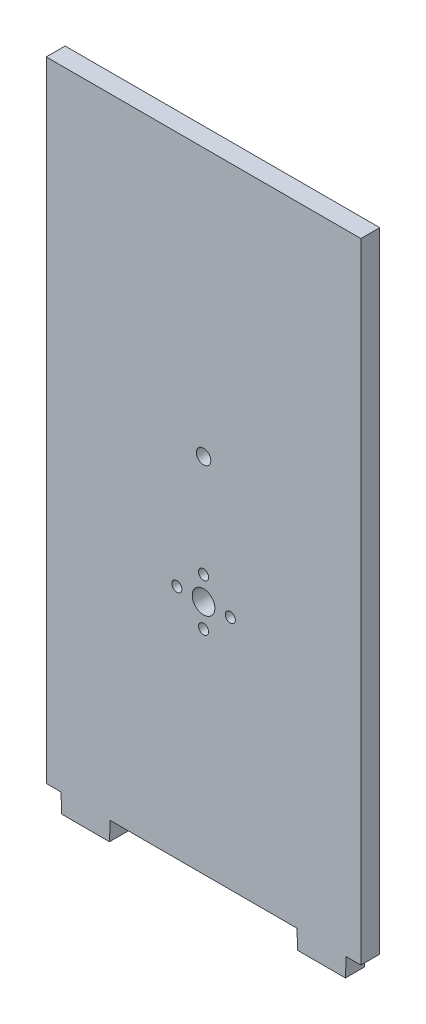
ISO-10303-21;
HEADER;
FILE_DESCRIPTION(('STEP AP214'),'2;1');
FILE_NAME('part.step','',(''),(''),'','','');
FILE_SCHEMA(('AUTOMOTIVE_DESIGN { 1 0 10303 214 1 1 1 1 }'));
ENDSEC;
DATA;
#1=APPLICATION_CONTEXT('core data for automotive mechanical design processes');
#2=APPLICATION_PROTOCOL_DEFINITION('international standard','automotive_design',2000,#1);
#3=PRODUCT_CONTEXT('',#1,'mechanical');
#4=PRODUCT('Part','Part','',(#3));
#5=PRODUCT_RELATED_PRODUCT_CATEGORY('part','',(#4));
#6=PRODUCT_DEFINITION_FORMATION('','',#4);
#7=PRODUCT_DEFINITION_CONTEXT('part definition',#1,'design');
#8=PRODUCT_DEFINITION('design','',#6,#7);
#9=PRODUCT_DEFINITION_SHAPE('','',#8);
#10=(LENGTH_UNIT() NAMED_UNIT(*) SI_UNIT(.MILLI.,.METRE.));
#11=(NAMED_UNIT(*) PLANE_ANGLE_UNIT() SI_UNIT($,.RADIAN.));
#12=(NAMED_UNIT(*) SI_UNIT($,.STERADIAN.) SOLID_ANGLE_UNIT());
#13=UNCERTAINTY_MEASURE_WITH_UNIT(LENGTH_MEASURE(1.E-05),#10,'distance_accuracy_value','');
#14=(GEOMETRIC_REPRESENTATION_CONTEXT(3) GLOBAL_UNCERTAINTY_ASSIGNED_CONTEXT((#13)) GLOBAL_UNIT_ASSIGNED_CONTEXT((#10,
#11,#12)) REPRESENTATION_CONTEXT('',''));
#15=CARTESIAN_POINT('',(0.,0.,0.));
#16=DIRECTION('',(0.,0.,1.));
#17=DIRECTION('',(1.,0.,0.));
#18=AXIS2_PLACEMENT_3D('',#15,#16,#17);
#19=CARTESIAN_POINT('',(-50.,-100.,6.));
#20=DIRECTION('',(0.,1.,0.));
#21=DIRECTION('',(0.,0.,1.));
#22=AXIS2_PLACEMENT_3D('',#19,#20,#21);
#23=PLANE('',#22);
#24=DIRECTION('',(1.,0.,0.));
#25=VECTOR('',#24,1.);
#26=CARTESIAN_POINT('',(-50.,-100.,6.));
#27=LINE('',#26,#25);
#28=CARTESIAN_POINT('',(45.3095246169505,-100.,6.));
#29=VERTEX_POINT('',#28);
#30=CARTESIAN_POINT('',(50.,-100.,6.));
#31=VERTEX_POINT('',#30);
#32=EDGE_CURVE('E55',#29,#31,#27,.T.);
#33=ORIENTED_EDGE('',*,*,#32,.F.);
#34=DIRECTION('',(0.,0.,1.));
#35=VECTOR('',#34,1.);
#36=CARTESIAN_POINT('',(45.3095246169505,-100.,-16.7318468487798));
#37=LINE('',#36,#35);
#38=CARTESIAN_POINT('',(45.3095246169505,-100.,0.));
#39=VERTEX_POINT('',#38);
#40=EDGE_CURVE('E144',#39,#29,#37,.T.);
#41=ORIENTED_EDGE('',*,*,#40,.F.);
#42=DIRECTION('',(1.,0.,0.));
#43=VECTOR('',#42,1.);
#44=CARTESIAN_POINT('',(-50.,-100.,0.));
#45=LINE('',#44,#43);
#46=CARTESIAN_POINT('',(50.,-100.,0.));
#47=VERTEX_POINT('',#46);
#48=EDGE_CURVE('E130',#39,#47,#45,.T.);
#49=ORIENTED_EDGE('',*,*,#48,.T.);
#50=DIRECTION('',(0.,0.,-1.));
#51=VECTOR('',#50,1.);
#52=CARTESIAN_POINT('',(50.,-100.,6.));
#53=LINE('',#52,#51);
#54=EDGE_CURVE('E48',#31,#47,#53,.T.);
#55=ORIENTED_EDGE('',*,*,#54,.F.);
#56=EDGE_LOOP('',(#33,#41,#49,#55));
#57=FACE_BOUND('',#56,.T.);
#58=ADVANCED_FACE('F39',(#57),#23,.F.);
#59=CARTESIAN_POINT('',(-29.6904753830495,-100.,0.));
#60=VERTEX_POINT('',#59);
#61=CARTESIAN_POINT('',(29.6904753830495,-100.,0.));
#62=VERTEX_POINT('',#61);
#63=EDGE_CURVE('E140',#60,#62,#45,.T.);
#64=ORIENTED_EDGE('',*,*,#63,.T.);
#65=DIRECTION('',(0.,0.,1.));
#66=VECTOR('',#65,1.);
#67=CARTESIAN_POINT('',(29.6904753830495,-100.,-16.7318468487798));
#68=LINE('',#67,#66);
#69=CARTESIAN_POINT('',(29.6904753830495,-100.,6.));
#70=VERTEX_POINT('',#69);
#71=EDGE_CURVE('E63',#62,#70,#68,.T.);
#72=ORIENTED_EDGE('',*,*,#71,.T.);
#73=CARTESIAN_POINT('',(-29.6904753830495,-100.,6.));
#74=VERTEX_POINT('',#73);
#75=EDGE_CURVE('E224',#74,#70,#27,.T.);
#76=ORIENTED_EDGE('',*,*,#75,.F.);
#77=DIRECTION('',(0.,0.,1.));
#78=VECTOR('',#77,1.);
#79=CARTESIAN_POINT('',(-29.6904753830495,-100.,-16.7318468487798));
#80=LINE('',#79,#78);
#81=EDGE_CURVE('E193',#60,#74,#80,.T.);
#82=ORIENTED_EDGE('',*,*,#81,.F.);
#83=EDGE_LOOP('',(#64,#72,#76,#82));
#84=FACE_BOUND('',#83,.T.);
#85=ADVANCED_FACE('F340',(#84),#23,.F.);
#86=CARTESIAN_POINT('',(-50.,-100.,6.));
#87=DIRECTION('',(1.,0.,0.));
#88=DIRECTION('',(0.,0.,-1.));
#89=AXIS2_PLACEMENT_3D('',#86,#87,#88);
#90=PLANE('',#89);
#91=DIRECTION('',(0.,-1.,0.));
#92=VECTOR('',#91,1.);
#93=CARTESIAN_POINT('',(-50.,-100.,0.));
#94=LINE('',#93,#92);
#95=CARTESIAN_POINT('',(-50.,100.,0.));
#96=VERTEX_POINT('',#95);
#97=CARTESIAN_POINT('',(-50.,-100.,0.));
#98=VERTEX_POINT('',#97);
#99=EDGE_CURVE('E141',#96,#98,#94,.T.);
#100=ORIENTED_EDGE('',*,*,#99,.T.);
#101=DIRECTION('',(0.,0.,-1.));
#102=VECTOR('',#101,1.);
#103=CARTESIAN_POINT('',(-50.,-100.,6.));
#104=LINE('',#103,#102);
#105=CARTESIAN_POINT('',(-50.,-100.,6.));
#106=VERTEX_POINT('',#105);
#107=EDGE_CURVE('E11',#106,#98,#104,.T.);
#108=ORIENTED_EDGE('',*,*,#107,.F.);
#109=DIRECTION('',(0.,-1.,0.));
#110=VECTOR('',#109,1.);
#111=CARTESIAN_POINT('',(-50.,-100.,6.));
#112=LINE('',#111,#110);
#113=CARTESIAN_POINT('',(-50.,100.,6.));
#114=VERTEX_POINT('',#113);
#115=EDGE_CURVE('E214',#114,#106,#112,.T.);
#116=ORIENTED_EDGE('',*,*,#115,.F.);
#117=DIRECTION('',(0.,0.,-1.));
#118=VECTOR('',#117,1.);
#119=CARTESIAN_POINT('',(-50.,100.,6.));
#120=LINE('',#119,#118);
#121=EDGE_CURVE('E230',#114,#96,#120,.T.);
#122=ORIENTED_EDGE('',*,*,#121,.T.);
#123=EDGE_LOOP('',(#100,#108,#116,#122));
#124=FACE_BOUND('',#123,.T.);
#125=ADVANCED_FACE('F41',(#124),#90,.F.);
#126=CARTESIAN_POINT('',(-45.3095246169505,-100.,0.));
#127=VERTEX_POINT('',#126);
#128=EDGE_CURVE('E143',#98,#127,#45,.T.);
#129=ORIENTED_EDGE('',*,*,#128,.T.);
#130=DIRECTION('',(0.,0.,1.));
#131=VECTOR('',#130,1.);
#132=CARTESIAN_POINT('',(-45.3095246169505,-100.,-16.7318468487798));
#133=LINE('',#132,#131);
#134=CARTESIAN_POINT('',(-45.3095246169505,-100.,6.));
#135=VERTEX_POINT('',#134);
#136=EDGE_CURVE('E204',#127,#135,#133,.T.);
#137=ORIENTED_EDGE('',*,*,#136,.T.);
#138=EDGE_CURVE('E219',#106,#135,#27,.T.);
#139=ORIENTED_EDGE('',*,*,#138,.F.);
#140=ORIENTED_EDGE('',*,*,#107,.T.);
#141=EDGE_LOOP('',(#129,#137,#139,#140));
#142=FACE_BOUND('',#141,.T.);
#143=ADVANCED_FACE('F341',(#142),#23,.F.);
#144=CARTESIAN_POINT('',(50.,-100.,6.));
#145=DIRECTION('',(-1.,0.,0.));
#146=DIRECTION('',(0.,0.,1.));
#147=AXIS2_PLACEMENT_3D('',#144,#145,#146);
#148=PLANE('',#147);
#149=DIRECTION('',(0.,1.,0.));
#150=VECTOR('',#149,1.);
#151=CARTESIAN_POINT('',(50.,-100.,0.));
#152=LINE('',#151,#150);
#153=CARTESIAN_POINT('',(50.,100.,0.));
#154=VERTEX_POINT('',#153);
#155=EDGE_CURVE('E137',#47,#154,#152,.T.);
#156=ORIENTED_EDGE('',*,*,#155,.T.);
#157=DIRECTION('',(0.,0.,-1.));
#158=VECTOR('',#157,1.);
#159=CARTESIAN_POINT('',(50.,100.,6.));
#160=LINE('',#159,#158);
#161=CARTESIAN_POINT('',(50.,100.,6.));
#162=VERTEX_POINT('',#161);
#163=EDGE_CURVE('E243',#162,#154,#160,.T.);
#164=ORIENTED_EDGE('',*,*,#163,.F.);
#165=DIRECTION('',(0.,1.,0.));
#166=VECTOR('',#165,1.);
#167=CARTESIAN_POINT('',(50.,-100.,6.));
#168=LINE('',#167,#166);
#169=EDGE_CURVE('E223',#31,#162,#168,.T.);
#170=ORIENTED_EDGE('',*,*,#169,.F.);
#171=ORIENTED_EDGE('',*,*,#54,.T.);
#172=EDGE_LOOP('',(#156,#164,#170,#171));
#173=FACE_BOUND('',#172,.T.);
#174=ADVANCED_FACE('F249',(#173),#148,.F.);
#175=CARTESIAN_POINT('',(-50.,100.,6.));
#176=DIRECTION('',(0.,-1.,0.));
#177=DIRECTION('',(0.,0.,-1.));
#178=AXIS2_PLACEMENT_3D('',#175,#176,#177);
#179=PLANE('',#178);
#180=DIRECTION('',(-1.,0.,0.));
#181=VECTOR('',#180,1.);
#182=CARTESIAN_POINT('',(-50.,100.,0.));
#183=LINE('',#182,#181);
#184=EDGE_CURVE('E218',#154,#96,#183,.T.);
#185=ORIENTED_EDGE('',*,*,#184,.T.);
#186=ORIENTED_EDGE('',*,*,#121,.F.);
#187=DIRECTION('',(-1.,0.,0.));
#188=VECTOR('',#187,1.);
#189=CARTESIAN_POINT('',(-50.,100.,6.));
#190=LINE('',#189,#188);
#191=EDGE_CURVE('E227',#162,#114,#190,.T.);
#192=ORIENTED_EDGE('',*,*,#191,.F.);
#193=ORIENTED_EDGE('',*,*,#163,.T.);
#194=EDGE_LOOP('',(#185,#186,#192,#193));
#195=FACE_BOUND('',#194,.T.);
#196=ADVANCED_FACE('F325',(#195),#179,.F.);
#197=CARTESIAN_POINT('',(0.,0.,6.));
#198=DIRECTION('',(0.,0.,-1.));
#199=DIRECTION('',(-1.,0.,0.));
#200=AXIS2_PLACEMENT_3D('',#197,#198,#199);
#201=PLANE('',#200);
#202=CARTESIAN_POINT('',(0.,15.,6.));
#203=DIRECTION('',(0.,0.,1.));
#204=DIRECTION('',(1.,0.,0.));
#205=AXIS2_PLACEMENT_3D('',#202,#203,#204);
#206=CIRCLE('',#205,2.3);
#207=CARTESIAN_POINT('',(2.30000000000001,15.,6.));
#208=VERTEX_POINT('',#207);
#209=EDGE_CURVE('E273',#208,#208,#206,.T.);
#210=ORIENTED_EDGE('',*,*,#209,.F.);
#211=EDGE_LOOP('',(#210));
#212=FACE_BOUND('',#211,.T.);
#213=CARTESIAN_POINT('',(8.50000000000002,-25.,6.));
#214=DIRECTION('',(0.,0.,1.));
#215=DIRECTION('',(1.,0.,0.));
#216=AXIS2_PLACEMENT_3D('',#213,#214,#215);
#217=CIRCLE('',#216,1.6);
#218=CARTESIAN_POINT('',(10.1,-25.,6.));
#219=VERTEX_POINT('',#218);
#220=EDGE_CURVE('E295',#219,#219,#217,.T.);
#221=ORIENTED_EDGE('',*,*,#220,.F.);
#222=EDGE_LOOP('',(#221));
#223=FACE_BOUND('',#222,.T.);
#224=CARTESIAN_POINT('',(0.,-32.5,6.));
#225=DIRECTION('',(0.,0.,1.));
#226=DIRECTION('',(1.,0.,0.));
#227=AXIS2_PLACEMENT_3D('',#224,#225,#226);
#228=CIRCLE('',#227,1.6);
#229=CARTESIAN_POINT('',(1.60000000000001,-32.5,6.));
#230=VERTEX_POINT('',#229);
#231=EDGE_CURVE('E287',#230,#230,#228,.T.);
#232=ORIENTED_EDGE('',*,*,#231,.F.);
#233=EDGE_LOOP('',(#232));
#234=FACE_BOUND('',#233,.T.);
#235=CARTESIAN_POINT('',(0.,-17.5,6.));
#236=DIRECTION('',(0.,0.,1.));
#237=DIRECTION('',(1.,0.,0.));
#238=AXIS2_PLACEMENT_3D('',#235,#236,#237);
#239=CIRCLE('',#238,1.6);
#240=CARTESIAN_POINT('',(1.60000000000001,-17.5,6.));
#241=VERTEX_POINT('',#240);
#242=EDGE_CURVE('E286',#241,#241,#239,.T.);
#243=ORIENTED_EDGE('',*,*,#242,.F.);
#244=EDGE_LOOP('',(#243));
#245=FACE_BOUND('',#244,.T.);
#246=CARTESIAN_POINT('',(0.,-25.,6.));
#247=DIRECTION('',(0.,0.,1.));
#248=DIRECTION('',(1.,0.,0.));
#249=AXIS2_PLACEMENT_3D('',#246,#247,#248);
#250=CIRCLE('',#249,3.6);
#251=CARTESIAN_POINT('',(3.60000000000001,-25.,6.));
#252=VERTEX_POINT('',#251);
#253=EDGE_CURVE('E303',#252,#252,#250,.T.);
#254=ORIENTED_EDGE('',*,*,#253,.F.);
#255=EDGE_LOOP('',(#254));
#256=FACE_BOUND('',#255,.T.);
#257=CARTESIAN_POINT('',(-8.49999999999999,-25.,6.));
#258=DIRECTION('',(0.,0.,1.));
#259=DIRECTION('',(1.,0.,0.));
#260=AXIS2_PLACEMENT_3D('',#257,#258,#259);
#261=CIRCLE('',#260,1.6);
#262=CARTESIAN_POINT('',(-6.89999999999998,-25.,6.));
#263=VERTEX_POINT('',#262);
#264=EDGE_CURVE('E317',#263,#263,#261,.T.);
#265=ORIENTED_EDGE('',*,*,#264,.F.);
#266=EDGE_LOOP('',(#265));
#267=FACE_BOUND('',#266,.T.);
#268=ORIENTED_EDGE('',*,*,#115,.T.);
#269=ORIENTED_EDGE('',*,*,#138,.T.);
#270=DIRECTION('',(0.0348994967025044,-0.999390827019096,0.));
#271=VECTOR('',#270,1.);
#272=CARTESIAN_POINT('',(-45.3095246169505,-100.,6.));
#273=LINE('',#272,#271);
#274=CARTESIAN_POINT('',(-45.1,-106.,6.));
#275=VERTEX_POINT('',#274);
#276=EDGE_CURVE('E179',#135,#275,#273,.T.);
#277=ORIENTED_EDGE('',*,*,#276,.T.);
#278=DIRECTION('',(1.,0.,0.));
#279=VECTOR('',#278,1.);
#280=CARTESIAN_POINT('',(-45.1,-106.,6.));
#281=LINE('',#280,#279);
#282=CARTESIAN_POINT('',(-29.9,-106.,6.));
#283=VERTEX_POINT('',#282);
#284=EDGE_CURVE('E178',#275,#283,#281,.T.);
#285=ORIENTED_EDGE('',*,*,#284,.T.);
#286=DIRECTION('',(0.0348994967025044,0.999390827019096,0.));
#287=VECTOR('',#286,1.);
#288=CARTESIAN_POINT('',(-29.6904753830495,-100.,6.));
#289=LINE('',#288,#287);
#290=EDGE_CURVE('E184',#283,#74,#289,.T.);
#291=ORIENTED_EDGE('',*,*,#290,.T.);
#292=ORIENTED_EDGE('',*,*,#75,.T.);
#293=DIRECTION('',(0.0348994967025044,-0.999390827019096,0.));
#294=VECTOR('',#293,1.);
#295=CARTESIAN_POINT('',(29.6904753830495,-100.,6.));
#296=LINE('',#295,#294);
#297=CARTESIAN_POINT('',(29.9,-106.,6.));
#298=VERTEX_POINT('',#297);
#299=EDGE_CURVE('E154',#70,#298,#296,.T.);
#300=ORIENTED_EDGE('',*,*,#299,.T.);
#301=DIRECTION('',(1.,0.,0.));
#302=VECTOR('',#301,1.);
#303=CARTESIAN_POINT('',(29.9,-106.,6.));
#304=LINE('',#303,#302);
#305=CARTESIAN_POINT('',(45.1,-106.,6.));
#306=VERTEX_POINT('',#305);
#307=EDGE_CURVE('E162',#298,#306,#304,.T.);
#308=ORIENTED_EDGE('',*,*,#307,.T.);
#309=DIRECTION('',(0.0348994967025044,0.999390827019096,0.));
#310=VECTOR('',#309,1.);
#311=CARTESIAN_POINT('',(45.3095246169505,-100.,6.));
#312=LINE('',#311,#310);
#313=EDGE_CURVE('E158',#306,#29,#312,.T.);
#314=ORIENTED_EDGE('',*,*,#313,.T.);
#315=ORIENTED_EDGE('',*,*,#32,.T.);
#316=ORIENTED_EDGE('',*,*,#169,.T.);
#317=ORIENTED_EDGE('',*,*,#191,.T.);
#318=EDGE_LOOP('',(#268,#269,#277,#285,#291,#292,#300,#308,#314,#315,#316,#317));
#319=FACE_BOUND('',#318,.T.);
#320=ADVANCED_FACE('F253',(#212,#223,#234,#245,#256,#267,#319),#201,.F.);
#321=CARTESIAN_POINT('',(0.,0.,0.));
#322=DIRECTION('',(0.,0.,-1.));
#323=DIRECTION('',(-1.,0.,0.));
#324=AXIS2_PLACEMENT_3D('',#321,#322,#323);
#325=PLANE('',#324);
#326=CARTESIAN_POINT('',(0.,15.,0.));
#327=DIRECTION('',(0.,0.,1.));
#328=DIRECTION('',(1.,0.,0.));
#329=AXIS2_PLACEMENT_3D('',#326,#327,#328);
#330=CIRCLE('',#329,2.3);
#331=CARTESIAN_POINT('',(2.30000000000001,15.,0.));
#332=VERTEX_POINT('',#331);
#333=EDGE_CURVE('E269',#332,#332,#330,.T.);
#334=ORIENTED_EDGE('',*,*,#333,.T.);
#335=EDGE_LOOP('',(#334));
#336=FACE_BOUND('',#335,.T.);
#337=CARTESIAN_POINT('',(8.50000000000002,-25.,0.));
#338=DIRECTION('',(0.,0.,1.));
#339=DIRECTION('',(1.,0.,0.));
#340=AXIS2_PLACEMENT_3D('',#337,#338,#339);
#341=CIRCLE('',#340,1.6);
#342=CARTESIAN_POINT('',(10.1,-25.,0.));
#343=VERTEX_POINT('',#342);
#344=EDGE_CURVE('E291',#343,#343,#341,.T.);
#345=ORIENTED_EDGE('',*,*,#344,.T.);
#346=EDGE_LOOP('',(#345));
#347=FACE_BOUND('',#346,.T.);
#348=CARTESIAN_POINT('',(0.,-32.5,0.));
#349=DIRECTION('',(0.,0.,1.));
#350=DIRECTION('',(1.,0.,0.));
#351=AXIS2_PLACEMENT_3D('',#348,#349,#350);
#352=CIRCLE('',#351,1.6);
#353=CARTESIAN_POINT('',(1.60000000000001,-32.5,0.));
#354=VERTEX_POINT('',#353);
#355=EDGE_CURVE('E282',#354,#354,#352,.T.);
#356=ORIENTED_EDGE('',*,*,#355,.T.);
#357=EDGE_LOOP('',(#356));
#358=FACE_BOUND('',#357,.T.);
#359=CARTESIAN_POINT('',(0.,-17.5,0.));
#360=DIRECTION('',(0.,0.,1.));
#361=DIRECTION('',(1.,0.,0.));
#362=AXIS2_PLACEMENT_3D('',#359,#360,#361);
#363=CIRCLE('',#362,1.6);
#364=CARTESIAN_POINT('',(1.60000000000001,-17.5,0.));
#365=VERTEX_POINT('',#364);
#366=EDGE_CURVE('E307',#365,#365,#363,.T.);
#367=ORIENTED_EDGE('',*,*,#366,.T.);
#368=EDGE_LOOP('',(#367));
#369=FACE_BOUND('',#368,.T.);
#370=CARTESIAN_POINT('',(0.,-25.,0.));
#371=DIRECTION('',(0.,0.,1.));
#372=DIRECTION('',(1.,0.,0.));
#373=AXIS2_PLACEMENT_3D('',#370,#371,#372);
#374=CIRCLE('',#373,3.6);
#375=CARTESIAN_POINT('',(3.60000000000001,-25.,0.));
#376=VERTEX_POINT('',#375);
#377=EDGE_CURVE('E279',#376,#376,#374,.T.);
#378=ORIENTED_EDGE('',*,*,#377,.T.);
#379=EDGE_LOOP('',(#378));
#380=FACE_BOUND('',#379,.T.);
#381=CARTESIAN_POINT('',(-8.49999999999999,-25.,0.));
#382=DIRECTION('',(0.,0.,1.));
#383=DIRECTION('',(1.,0.,0.));
#384=AXIS2_PLACEMENT_3D('',#381,#382,#383);
#385=CIRCLE('',#384,1.6);
#386=CARTESIAN_POINT('',(-6.89999999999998,-25.,0.));
#387=VERTEX_POINT('',#386);
#388=EDGE_CURVE('E299',#387,#387,#385,.T.);
#389=ORIENTED_EDGE('',*,*,#388,.T.);
#390=EDGE_LOOP('',(#389));
#391=FACE_BOUND('',#390,.T.);
#392=ORIENTED_EDGE('',*,*,#99,.F.);
#393=ORIENTED_EDGE('',*,*,#184,.F.);
#394=ORIENTED_EDGE('',*,*,#155,.F.);
#395=ORIENTED_EDGE('',*,*,#48,.F.);
#396=DIRECTION('',(0.0348994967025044,0.999390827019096,0.));
#397=VECTOR('',#396,1.);
#398=CARTESIAN_POINT('',(45.3095246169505,-100.,0.));
#399=LINE('',#398,#397);
#400=CARTESIAN_POINT('',(45.1,-106.,0.));
#401=VERTEX_POINT('',#400);
#402=EDGE_CURVE('E134',#401,#39,#399,.T.);
#403=ORIENTED_EDGE('',*,*,#402,.F.);
#404=DIRECTION('',(1.,0.,0.));
#405=VECTOR('',#404,1.);
#406=CARTESIAN_POINT('',(29.9,-106.,0.));
#407=LINE('',#406,#405);
#408=CARTESIAN_POINT('',(29.9,-106.,0.));
#409=VERTEX_POINT('',#408);
#410=EDGE_CURVE('E164',#409,#401,#407,.T.);
#411=ORIENTED_EDGE('',*,*,#410,.F.);
#412=DIRECTION('',(0.0348994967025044,-0.999390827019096,0.));
#413=VECTOR('',#412,1.);
#414=CARTESIAN_POINT('',(29.6904753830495,-100.,0.));
#415=LINE('',#414,#413);
#416=EDGE_CURVE('E168',#62,#409,#415,.T.);
#417=ORIENTED_EDGE('',*,*,#416,.F.);
#418=ORIENTED_EDGE('',*,*,#63,.F.);
#419=DIRECTION('',(0.0348994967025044,0.999390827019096,0.));
#420=VECTOR('',#419,1.);
#421=CARTESIAN_POINT('',(-29.6904753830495,-100.,0.));
#422=LINE('',#421,#420);
#423=CARTESIAN_POINT('',(-29.9,-106.,0.));
#424=VERTEX_POINT('',#423);
#425=EDGE_CURVE('E183',#424,#60,#422,.T.);
#426=ORIENTED_EDGE('',*,*,#425,.F.);
#427=DIRECTION('',(1.,0.,0.));
#428=VECTOR('',#427,1.);
#429=CARTESIAN_POINT('',(-45.1,-106.,0.));
#430=LINE('',#429,#428);
#431=CARTESIAN_POINT('',(-45.1,-106.,0.));
#432=VERTEX_POINT('',#431);
#433=EDGE_CURVE('E194',#432,#424,#430,.T.);
#434=ORIENTED_EDGE('',*,*,#433,.F.);
#435=DIRECTION('',(0.0348994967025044,-0.999390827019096,0.));
#436=VECTOR('',#435,1.);
#437=CARTESIAN_POINT('',(-45.3095246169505,-100.,0.));
#438=LINE('',#437,#436);
#439=EDGE_CURVE('E200',#127,#432,#438,.T.);
#440=ORIENTED_EDGE('',*,*,#439,.F.);
#441=ORIENTED_EDGE('',*,*,#128,.F.);
#442=EDGE_LOOP('',(#392,#393,#394,#395,#403,#411,#417,#418,#426,#434,#440,#441));
#443=FACE_BOUND('',#442,.T.);
#444=ADVANCED_FACE('F132',(#336,#347,#358,#369,#380,#391,#443),#325,.T.);
#445=CARTESIAN_POINT('',(-29.6904753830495,-100.,-16.7318468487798));
#446=DIRECTION('',(0.999390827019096,-0.0348994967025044,0.));
#447=DIRECTION('',(0.0348994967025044,0.999390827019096,0.));
#448=AXIS2_PLACEMENT_3D('',#445,#446,#447);
#449=PLANE('',#448);
#450=DIRECTION('',(0.,0.,1.));
#451=VECTOR('',#450,1.);
#452=CARTESIAN_POINT('',(-29.9,-106.,-16.7318468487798));
#453=LINE('',#452,#451);
#454=EDGE_CURVE('E198',#424,#283,#453,.T.);
#455=ORIENTED_EDGE('',*,*,#454,.F.);
#456=ORIENTED_EDGE('',*,*,#425,.T.);
#457=ORIENTED_EDGE('',*,*,#81,.T.);
#458=ORIENTED_EDGE('',*,*,#290,.F.);
#459=EDGE_LOOP('',(#455,#456,#457,#458));
#460=FACE_BOUND('',#459,.T.);
#461=ADVANCED_FACE('F332',(#460),#449,.T.);
#462=CARTESIAN_POINT('',(-45.3095246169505,-100.,-16.7318468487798));
#463=DIRECTION('',(-0.999390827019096,-0.0348994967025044,0.));
#464=DIRECTION('',(0.0348994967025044,-0.999390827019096,0.));
#465=AXIS2_PLACEMENT_3D('',#462,#463,#464);
#466=PLANE('',#465);
#467=ORIENTED_EDGE('',*,*,#136,.F.);
#468=ORIENTED_EDGE('',*,*,#439,.T.);
#469=DIRECTION('',(0.,0.,1.));
#470=VECTOR('',#469,1.);
#471=CARTESIAN_POINT('',(-45.1,-106.,-16.7318468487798));
#472=LINE('',#471,#470);
#473=EDGE_CURVE('E199',#432,#275,#472,.T.);
#474=ORIENTED_EDGE('',*,*,#473,.T.);
#475=ORIENTED_EDGE('',*,*,#276,.F.);
#476=EDGE_LOOP('',(#467,#468,#474,#475));
#477=FACE_BOUND('',#476,.T.);
#478=ADVANCED_FACE('F357',(#477),#466,.T.);
#479=CARTESIAN_POINT('',(-45.1,-106.,-16.7318468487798));
#480=DIRECTION('',(0.,-1.,0.));
#481=DIRECTION('',(0.,0.,-1.));
#482=AXIS2_PLACEMENT_3D('',#479,#480,#481);
#483=PLANE('',#482);
#484=ORIENTED_EDGE('',*,*,#473,.F.);
#485=ORIENTED_EDGE('',*,*,#433,.T.);
#486=ORIENTED_EDGE('',*,*,#454,.T.);
#487=ORIENTED_EDGE('',*,*,#284,.F.);
#488=EDGE_LOOP('',(#484,#485,#486,#487));
#489=FACE_BOUND('',#488,.T.);
#490=ADVANCED_FACE('F361',(#489),#483,.T.);
#491=CARTESIAN_POINT('',(45.3095246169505,-100.,-16.7318468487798));
#492=DIRECTION('',(0.999390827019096,-0.0348994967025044,0.));
#493=DIRECTION('',(0.0348994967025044,0.999390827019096,0.));
#494=AXIS2_PLACEMENT_3D('',#491,#492,#493);
#495=PLANE('',#494);
#496=DIRECTION('',(0.,0.,1.));
#497=VECTOR('',#496,1.);
#498=CARTESIAN_POINT('',(45.1,-106.,-16.7318468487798));
#499=LINE('',#498,#497);
#500=EDGE_CURVE('E152',#401,#306,#499,.T.);
#501=ORIENTED_EDGE('',*,*,#500,.F.);
#502=ORIENTED_EDGE('',*,*,#402,.T.);
#503=ORIENTED_EDGE('',*,*,#40,.T.);
#504=ORIENTED_EDGE('',*,*,#313,.F.);
#505=EDGE_LOOP('',(#501,#502,#503,#504));
#506=FACE_BOUND('',#505,.T.);
#507=ADVANCED_FACE('F151',(#506),#495,.T.);
#508=CARTESIAN_POINT('',(29.6904753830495,-100.,-16.7318468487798));
#509=DIRECTION('',(-0.999390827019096,-0.0348994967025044,0.));
#510=DIRECTION('',(0.0348994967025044,-0.999390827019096,0.));
#511=AXIS2_PLACEMENT_3D('',#508,#509,#510);
#512=PLANE('',#511);
#513=ORIENTED_EDGE('',*,*,#71,.F.);
#514=ORIENTED_EDGE('',*,*,#416,.T.);
#515=DIRECTION('',(0.,0.,1.));
#516=VECTOR('',#515,1.);
#517=CARTESIAN_POINT('',(29.9,-106.,-16.7318468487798));
#518=LINE('',#517,#516);
#519=EDGE_CURVE('E167',#409,#298,#518,.T.);
#520=ORIENTED_EDGE('',*,*,#519,.T.);
#521=ORIENTED_EDGE('',*,*,#299,.F.);
#522=EDGE_LOOP('',(#513,#514,#520,#521));
#523=FACE_BOUND('',#522,.T.);
#524=ADVANCED_FACE('F262',(#523),#512,.T.);
#525=CARTESIAN_POINT('',(29.9,-106.,-16.7318468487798));
#526=DIRECTION('',(0.,-1.,0.));
#527=DIRECTION('',(0.,0.,-1.));
#528=AXIS2_PLACEMENT_3D('',#525,#526,#527);
#529=PLANE('',#528);
#530=ORIENTED_EDGE('',*,*,#519,.F.);
#531=ORIENTED_EDGE('',*,*,#410,.T.);
#532=ORIENTED_EDGE('',*,*,#500,.T.);
#533=ORIENTED_EDGE('',*,*,#307,.F.);
#534=EDGE_LOOP('',(#530,#531,#532,#533));
#535=FACE_BOUND('',#534,.T.);
#536=ADVANCED_FACE('F267',(#535),#529,.T.);
#537=CARTESIAN_POINT('',(-8.49999999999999,-25.,0.));
#538=DIRECTION('',(0.,0.,1.));
#539=DIRECTION('',(1.,0.,0.));
#540=AXIS2_PLACEMENT_3D('',#537,#538,#539);
#541=CYLINDRICAL_SURFACE('',#540,1.6);
#542=ORIENTED_EDGE('',*,*,#388,.F.);
#543=EDGE_LOOP('',(#542));
#544=FACE_BOUND('',#543,.T.);
#545=ORIENTED_EDGE('',*,*,#264,.T.);
#546=EDGE_LOOP('',(#545));
#547=FACE_BOUND('',#546,.T.);
#548=ADVANCED_FACE('F322',(#544,#547),#541,.F.);
#549=CARTESIAN_POINT('',(0.,-25.,0.));
#550=DIRECTION('',(0.,0.,1.));
#551=DIRECTION('',(1.,0.,0.));
#552=AXIS2_PLACEMENT_3D('',#549,#550,#551);
#553=CYLINDRICAL_SURFACE('',#552,3.6);
#554=ORIENTED_EDGE('',*,*,#377,.F.);
#555=EDGE_LOOP('',(#554));
#556=FACE_BOUND('',#555,.T.);
#557=ORIENTED_EDGE('',*,*,#253,.T.);
#558=EDGE_LOOP('',(#557));
#559=FACE_BOUND('',#558,.T.);
#560=ADVANCED_FACE('F382',(#556,#559),#553,.F.);
#561=CARTESIAN_POINT('',(0.,-17.5,0.));
#562=DIRECTION('',(0.,0.,1.));
#563=DIRECTION('',(1.,0.,0.));
#564=AXIS2_PLACEMENT_3D('',#561,#562,#563);
#565=CYLINDRICAL_SURFACE('',#564,1.6);
#566=ORIENTED_EDGE('',*,*,#366,.F.);
#567=EDGE_LOOP('',(#566));
#568=FACE_BOUND('',#567,.T.);
#569=ORIENTED_EDGE('',*,*,#242,.T.);
#570=EDGE_LOOP('',(#569));
#571=FACE_BOUND('',#570,.T.);
#572=ADVANCED_FACE('F384',(#568,#571),#565,.F.);
#573=CARTESIAN_POINT('',(0.,-32.5,0.));
#574=DIRECTION('',(0.,0.,1.));
#575=DIRECTION('',(1.,0.,0.));
#576=AXIS2_PLACEMENT_3D('',#573,#574,#575);
#577=CYLINDRICAL_SURFACE('',#576,1.6);
#578=ORIENTED_EDGE('',*,*,#355,.F.);
#579=EDGE_LOOP('',(#578));
#580=FACE_BOUND('',#579,.T.);
#581=ORIENTED_EDGE('',*,*,#231,.T.);
#582=EDGE_LOOP('',(#581));
#583=FACE_BOUND('',#582,.T.);
#584=ADVANCED_FACE('F387',(#580,#583),#577,.F.);
#585=CARTESIAN_POINT('',(8.50000000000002,-25.,0.));
#586=DIRECTION('',(0.,0.,1.));
#587=DIRECTION('',(1.,0.,0.));
#588=AXIS2_PLACEMENT_3D('',#585,#586,#587);
#589=CYLINDRICAL_SURFACE('',#588,1.6);
#590=ORIENTED_EDGE('',*,*,#344,.F.);
#591=EDGE_LOOP('',(#590));
#592=FACE_BOUND('',#591,.T.);
#593=ORIENTED_EDGE('',*,*,#220,.T.);
#594=EDGE_LOOP('',(#593));
#595=FACE_BOUND('',#594,.T.);
#596=ADVANCED_FACE('F392',(#592,#595),#589,.F.);
#597=CARTESIAN_POINT('',(0.,15.,0.));
#598=DIRECTION('',(0.,0.,1.));
#599=DIRECTION('',(1.,0.,0.));
#600=AXIS2_PLACEMENT_3D('',#597,#598,#599);
#601=CYLINDRICAL_SURFACE('',#600,2.3);
#602=ORIENTED_EDGE('',*,*,#333,.F.);
#603=EDGE_LOOP('',(#602));
#604=FACE_BOUND('',#603,.T.);
#605=ORIENTED_EDGE('',*,*,#209,.T.);
#606=EDGE_LOOP('',(#605));
#607=FACE_BOUND('',#606,.T.);
#608=ADVANCED_FACE('F395',(#604,#607),#601,.F.);
#609=CLOSED_SHELL('',(#58,#85,#125,#143,#174,#196,#320,#444,#461,#478,#490,#507,#524,#536,#548,
#560,#572,#584,#596,#608));
#610=MANIFOLD_SOLID_BREP('B2',#609);
#611=ADVANCED_BREP_SHAPE_REPRESENTATION('',(#18,#610),#14);
#612=SHAPE_DEFINITION_REPRESENTATION(#9,#611);
ENDSEC;
END-ISO-10303-21;
